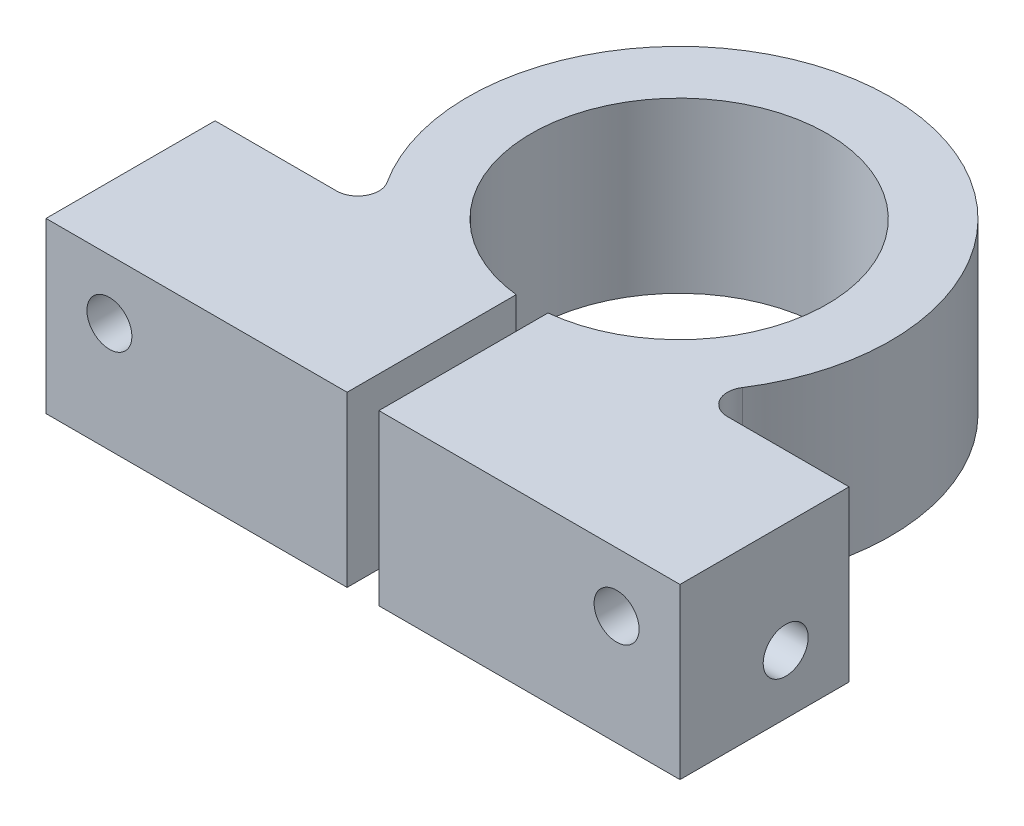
ISO-10303-21;
HEADER;
FILE_DESCRIPTION(('STEP AP214'),'2;1');
FILE_NAME('part.step','',(''),(''),'','','');
FILE_SCHEMA(('AUTOMOTIVE_DESIGN { 1 0 10303 214 1 1 1 1 }'));
ENDSEC;
DATA;
#1=APPLICATION_CONTEXT('core data for automotive mechanical design processes');
#2=APPLICATION_PROTOCOL_DEFINITION('international standard','automotive_design',2000,#1);
#3=PRODUCT_CONTEXT('',#1,'mechanical');
#4=PRODUCT('Part','Part','',(#3));
#5=PRODUCT_RELATED_PRODUCT_CATEGORY('part','',(#4));
#6=PRODUCT_DEFINITION_FORMATION('','',#4);
#7=PRODUCT_DEFINITION_CONTEXT('part definition',#1,'design');
#8=PRODUCT_DEFINITION('design','',#6,#7);
#9=PRODUCT_DEFINITION_SHAPE('','',#8);
#10=(LENGTH_UNIT() NAMED_UNIT(*) SI_UNIT(.MILLI.,.METRE.));
#11=(NAMED_UNIT(*) PLANE_ANGLE_UNIT() SI_UNIT($,.RADIAN.));
#12=(NAMED_UNIT(*) SI_UNIT($,.STERADIAN.) SOLID_ANGLE_UNIT());
#13=UNCERTAINTY_MEASURE_WITH_UNIT(LENGTH_MEASURE(1.E-05),#10,'distance_accuracy_value','');
#14=(GEOMETRIC_REPRESENTATION_CONTEXT(3) GLOBAL_UNCERTAINTY_ASSIGNED_CONTEXT((#13)) GLOBAL_UNIT_ASSIGNED_CONTEXT((#10,
#11,#12)) REPRESENTATION_CONTEXT('',''));
#15=CARTESIAN_POINT('',(0.,0.,0.));
#16=DIRECTION('',(0.,0.,1.));
#17=DIRECTION('',(1.,0.,0.));
#18=AXIS2_PLACEMENT_3D('',#15,#16,#17);
#19=CARTESIAN_POINT('',(-29.355357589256,25.4,18.9213795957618));
#20=DIRECTION('',(0.,-1.,0.));
#21=DIRECTION('',(0.,0.,-1.));
#22=AXIS2_PLACEMENT_3D('',#19,#20,#21);
#23=CYLINDRICAL_SURFACE('',#22,3.175);
#24=CARTESIAN_POINT('',(-29.355357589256,0.,18.9213795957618));
#25=DIRECTION('',(0.,-1.,0.));
#26=DIRECTION('',(0.,0.,1.));
#27=AXIS2_PLACEMENT_3D('',#24,#25,#26);
#28=CIRCLE('',#27,3.175);
#29=CARTESIAN_POINT('',(-26.6866887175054,0.,17.2012541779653));
#30=VERTEX_POINT('',#29);
#31=CARTESIAN_POINT('',(-29.355357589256,0.,22.0963795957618));
#32=VERTEX_POINT('',#31);
#33=EDGE_CURVE('E124',#30,#32,#28,.T.);
#34=ORIENTED_EDGE('',*,*,#33,.T.);
#35=DIRECTION('',(0.,-1.,0.));
#36=VECTOR('',#35,1.);
#37=CARTESIAN_POINT('',(-29.355357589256,25.4,22.0963795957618));
#38=LINE('',#37,#36);
#39=CARTESIAN_POINT('',(-29.355357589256,25.4,22.0963795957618));
#40=VERTEX_POINT('',#39);
#41=EDGE_CURVE('E11',#40,#32,#38,.T.);
#42=ORIENTED_EDGE('',*,*,#41,.F.);
#43=CARTESIAN_POINT('',(-29.355357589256,25.4,18.9213795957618));
#44=DIRECTION('',(0.,-1.,0.));
#45=DIRECTION('',(0.,0.,1.));
#46=AXIS2_PLACEMENT_3D('',#43,#44,#45);
#47=CIRCLE('',#46,3.175);
#48=CARTESIAN_POINT('',(-26.6866887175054,25.4,17.2012541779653));
#49=VERTEX_POINT('',#48);
#50=EDGE_CURVE('E164',#49,#40,#47,.T.);
#51=ORIENTED_EDGE('',*,*,#50,.F.);
#52=DIRECTION('',(0.,-1.,0.));
#53=VECTOR('',#52,1.);
#54=CARTESIAN_POINT('',(-26.6866887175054,25.4,17.2012541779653));
#55=LINE('',#54,#53);
#56=EDGE_CURVE('E137',#49,#30,#55,.T.);
#57=ORIENTED_EDGE('',*,*,#56,.T.);
#58=EDGE_LOOP('',(#34,#42,#51,#57));
#59=FACE_BOUND('',#58,.T.);
#60=ADVANCED_FACE('F32',(#59),#23,.F.);
#61=CARTESIAN_POINT('',(-47.625,25.4,22.0963795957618));
#62=DIRECTION('',(0.,0.,1.));
#63=DIRECTION('',(1.,0.,0.));
#64=AXIS2_PLACEMENT_3D('',#61,#62,#63);
#65=PLANE('',#64);
#66=CARTESIAN_POINT('',(-38.1,16.51,22.0963795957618));
#67=DIRECTION('',(0.,0.,-1.));
#68=DIRECTION('',(-1.,0.,0.));
#69=AXIS2_PLACEMENT_3D('',#66,#67,#68);
#70=CIRCLE('',#69,3.37819999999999);
#71=CARTESIAN_POINT('',(-41.4782,16.51,22.0963795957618));
#72=VERTEX_POINT('',#71);
#73=EDGE_CURVE('E305',#72,#72,#70,.T.);
#74=ORIENTED_EDGE('',*,*,#73,.F.);
#75=EDGE_LOOP('',(#74));
#76=FACE_BOUND('',#75,.T.);
#77=DIRECTION('',(-1.,0.,0.));
#78=VECTOR('',#77,1.);
#79=CARTESIAN_POINT('',(-47.625,0.,22.0963795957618));
#80=LINE('',#79,#78);
#81=CARTESIAN_POINT('',(-47.625,0.,22.0963795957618));
#82=VERTEX_POINT('',#81);
#83=EDGE_CURVE('E120',#32,#82,#80,.T.);
#84=ORIENTED_EDGE('',*,*,#83,.T.);
#85=DIRECTION('',(0.,-1.,0.));
#86=VECTOR('',#85,1.);
#87=CARTESIAN_POINT('',(-47.625,25.4,22.0963795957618));
#88=LINE('',#87,#86);
#89=CARTESIAN_POINT('',(-47.625,25.4,22.0963795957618));
#90=VERTEX_POINT('',#89);
#91=EDGE_CURVE('E39',#90,#82,#88,.T.);
#92=ORIENTED_EDGE('',*,*,#91,.F.);
#93=DIRECTION('',(-1.,0.,0.));
#94=VECTOR('',#93,1.);
#95=CARTESIAN_POINT('',(-47.625,25.4,22.0963795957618));
#96=LINE('',#95,#94);
#97=EDGE_CURVE('E133',#40,#90,#96,.T.);
#98=ORIENTED_EDGE('',*,*,#97,.F.);
#99=ORIENTED_EDGE('',*,*,#41,.T.);
#100=EDGE_LOOP('',(#84,#92,#98,#99));
#101=FACE_BOUND('',#100,.T.);
#102=ADVANCED_FACE('F132',(#76,#101),#65,.F.);
#103=CARTESIAN_POINT('',(-47.625,25.4,22.0963795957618));
#104=DIRECTION('',(1.,0.,0.));
#105=DIRECTION('',(0.,0.,-1.));
#106=AXIS2_PLACEMENT_3D('',#103,#104,#105);
#107=PLANE('',#106);
#108=CARTESIAN_POINT('',(-47.625,8.89,31.6213795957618));
#109=DIRECTION('',(-1.,0.,0.));
#110=DIRECTION('',(0.,0.,1.));
#111=AXIS2_PLACEMENT_3D('',#108,#109,#110);
#112=CIRCLE('',#111,3.37819999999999);
#113=CARTESIAN_POINT('',(-47.625,8.89,34.9995795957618));
#114=VERTEX_POINT('',#113);
#115=EDGE_CURVE('E315',#114,#114,#112,.T.);
#116=ORIENTED_EDGE('',*,*,#115,.F.);
#117=EDGE_LOOP('',(#116));
#118=FACE_BOUND('',#117,.T.);
#119=DIRECTION('',(0.,0.,1.));
#120=VECTOR('',#119,1.);
#121=CARTESIAN_POINT('',(-47.625,0.,22.0963795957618));
#122=LINE('',#121,#120);
#123=CARTESIAN_POINT('',(-47.625,0.,47.4963795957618));
#124=VERTEX_POINT('',#123);
#125=EDGE_CURVE('E126',#82,#124,#122,.T.);
#126=ORIENTED_EDGE('',*,*,#125,.T.);
#127=DIRECTION('',(0.,-1.,0.));
#128=VECTOR('',#127,1.);
#129=CARTESIAN_POINT('',(-47.625,25.4,47.4963795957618));
#130=LINE('',#129,#128);
#131=CARTESIAN_POINT('',(-47.625,25.4,47.4963795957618));
#132=VERTEX_POINT('',#131);
#133=EDGE_CURVE('E210',#132,#124,#130,.T.);
#134=ORIENTED_EDGE('',*,*,#133,.F.);
#135=DIRECTION('',(0.,0.,1.));
#136=VECTOR('',#135,1.);
#137=CARTESIAN_POINT('',(-47.625,25.4,22.0963795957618));
#138=LINE('',#137,#136);
#139=EDGE_CURVE('E167',#90,#132,#138,.T.);
#140=ORIENTED_EDGE('',*,*,#139,.F.);
#141=ORIENTED_EDGE('',*,*,#91,.T.);
#142=EDGE_LOOP('',(#126,#134,#140,#141));
#143=FACE_BOUND('',#142,.T.);
#144=ADVANCED_FACE('F214',(#118,#143),#107,.F.);
#145=CARTESIAN_POINT('',(-47.625,25.4,47.4963795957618));
#146=DIRECTION('',(0.,0.,-1.));
#147=DIRECTION('',(-1.,0.,0.));
#148=AXIS2_PLACEMENT_3D('',#145,#146,#147);
#149=PLANE('',#148);
#150=CARTESIAN_POINT('',(-38.1,16.51,47.4963795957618));
#151=DIRECTION('',(0.,0.,-1.));
#152=DIRECTION('',(-1.,0.,0.));
#153=AXIS2_PLACEMENT_3D('',#150,#151,#152);
#154=CIRCLE('',#153,3.3782);
#155=CARTESIAN_POINT('',(-41.4782,16.51,47.4963795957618));
#156=VERTEX_POINT('',#155);
#157=EDGE_CURVE('E301',#156,#156,#154,.T.);
#158=ORIENTED_EDGE('',*,*,#157,.T.);
#159=EDGE_LOOP('',(#158));
#160=FACE_BOUND('',#159,.T.);
#161=DIRECTION('',(1.,0.,0.));
#162=VECTOR('',#161,1.);
#163=CARTESIAN_POINT('',(-47.625,0.,47.4963795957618));
#164=LINE('',#163,#162);
#165=CARTESIAN_POINT('',(-2.3876,0.,47.4963795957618));
#166=VERTEX_POINT('',#165);
#167=EDGE_CURVE('E146',#124,#166,#164,.T.);
#168=ORIENTED_EDGE('',*,*,#167,.T.);
#169=DIRECTION('',(0.,-1.,0.));
#170=VECTOR('',#169,1.);
#171=CARTESIAN_POINT('',(-2.3876,25.4,47.4963795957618));
#172=LINE('',#171,#170);
#173=CARTESIAN_POINT('',(-2.3876,25.4,47.4963795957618));
#174=VERTEX_POINT('',#173);
#175=EDGE_CURVE('E207',#174,#166,#172,.T.);
#176=ORIENTED_EDGE('',*,*,#175,.F.);
#177=DIRECTION('',(1.,0.,0.));
#178=VECTOR('',#177,1.);
#179=CARTESIAN_POINT('',(-47.625,25.4,47.4963795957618));
#180=LINE('',#179,#178);
#181=EDGE_CURVE('E169',#132,#174,#180,.T.);
#182=ORIENTED_EDGE('',*,*,#181,.F.);
#183=ORIENTED_EDGE('',*,*,#133,.T.);
#184=EDGE_LOOP('',(#168,#176,#182,#183));
#185=FACE_BOUND('',#184,.T.);
#186=ADVANCED_FACE('F222',(#160,#185),#149,.F.);
#187=CARTESIAN_POINT('',(-2.3876,25.4,47.4963795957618));
#188=DIRECTION('',(-1.,0.,0.));
#189=DIRECTION('',(0.,0.,1.));
#190=AXIS2_PLACEMENT_3D('',#187,#188,#189);
#191=PLANE('',#190);
#192=CARTESIAN_POINT('',(-2.3876,8.89,31.6213795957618));
#193=DIRECTION('',(-1.,0.,0.));
#194=DIRECTION('',(0.,0.,1.));
#195=AXIS2_PLACEMENT_3D('',#192,#193,#194);
#196=CIRCLE('',#195,3.37819999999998);
#197=CARTESIAN_POINT('',(-2.3876,8.89,34.9995795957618));
#198=VERTEX_POINT('',#197);
#199=EDGE_CURVE('E138',#198,#198,#196,.T.);
#200=ORIENTED_EDGE('',*,*,#199,.T.);
#201=EDGE_LOOP('',(#200));
#202=FACE_BOUND('',#201,.T.);
#203=DIRECTION('',(0.,0.,-1.));
#204=VECTOR('',#203,1.);
#205=CARTESIAN_POINT('',(-2.3876,0.,47.4963795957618));
#206=LINE('',#205,#204);
#207=CARTESIAN_POINT('',(-2.3876,0.,22.0963795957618));
#208=VERTEX_POINT('',#207);
#209=EDGE_CURVE('E148',#166,#208,#206,.T.);
#210=ORIENTED_EDGE('',*,*,#209,.T.);
#211=DIRECTION('',(0.,-1.,0.));
#212=VECTOR('',#211,1.);
#213=CARTESIAN_POINT('',(-2.3876,25.4,22.0963795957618));
#214=LINE('',#213,#212);
#215=CARTESIAN_POINT('',(-2.3876,25.4,22.0963795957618));
#216=VERTEX_POINT('',#215);
#217=EDGE_CURVE('E204',#216,#208,#214,.T.);
#218=ORIENTED_EDGE('',*,*,#217,.F.);
#219=DIRECTION('',(0.,0.,-1.));
#220=VECTOR('',#219,1.);
#221=CARTESIAN_POINT('',(-2.3876,25.4,47.4963795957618));
#222=LINE('',#221,#220);
#223=EDGE_CURVE('E171',#174,#216,#222,.T.);
#224=ORIENTED_EDGE('',*,*,#223,.F.);
#225=ORIENTED_EDGE('',*,*,#175,.T.);
#226=EDGE_LOOP('',(#210,#218,#224,#225));
#227=FACE_BOUND('',#226,.T.);
#228=ADVANCED_FACE('F225',(#202,#227),#191,.F.);
#229=CARTESIAN_POINT('',(0.,25.4,0.));
#230=DIRECTION('',(0.,-1.,0.));
#231=DIRECTION('',(0.,0.,-1.));
#232=AXIS2_PLACEMENT_3D('',#229,#230,#231);
#233=CYLINDRICAL_SURFACE('',#232,22.225);
#234=CARTESIAN_POINT('',(0.,0.,0.));
#235=DIRECTION('',(0.,-1.,0.));
#236=DIRECTION('',(0.,0.,1.));
#237=AXIS2_PLACEMENT_3D('',#234,#235,#236);
#238=CIRCLE('',#237,22.225);
#239=CARTESIAN_POINT('',(2.3876,0.,22.0963795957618));
#240=VERTEX_POINT('',#239);
#241=EDGE_CURVE('E150',#208,#240,#238,.T.);
#242=ORIENTED_EDGE('',*,*,#241,.T.);
#243=DIRECTION('',(0.,-1.,0.));
#244=VECTOR('',#243,1.);
#245=CARTESIAN_POINT('',(2.3876,25.4,22.0963795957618));
#246=LINE('',#245,#244);
#247=CARTESIAN_POINT('',(2.3876,25.4,22.0963795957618));
#248=VERTEX_POINT('',#247);
#249=EDGE_CURVE('E201',#248,#240,#246,.T.);
#250=ORIENTED_EDGE('',*,*,#249,.F.);
#251=CARTESIAN_POINT('',(0.,25.4,0.));
#252=DIRECTION('',(0.,-1.,0.));
#253=DIRECTION('',(0.,0.,1.));
#254=AXIS2_PLACEMENT_3D('',#251,#252,#253);
#255=CIRCLE('',#254,22.225);
#256=EDGE_CURVE('E173',#216,#248,#255,.T.);
#257=ORIENTED_EDGE('',*,*,#256,.F.);
#258=ORIENTED_EDGE('',*,*,#217,.T.);
#259=EDGE_LOOP('',(#242,#250,#257,#258));
#260=FACE_BOUND('',#259,.T.);
#261=ADVANCED_FACE('F230',(#260),#233,.F.);
#262=CARTESIAN_POINT('',(2.3876,25.4,47.4963795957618));
#263=DIRECTION('',(1.,0.,0.));
#264=DIRECTION('',(0.,0.,-1.));
#265=AXIS2_PLACEMENT_3D('',#262,#263,#264);
#266=PLANE('',#265);
#267=CARTESIAN_POINT('',(2.3876,8.89,31.6213795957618));
#268=DIRECTION('',(1.,0.,0.));
#269=DIRECTION('',(0.,0.,-1.));
#270=AXIS2_PLACEMENT_3D('',#267,#268,#269);
#271=CIRCLE('',#270,3.37819999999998);
#272=CARTESIAN_POINT('',(2.3876,8.89,28.2431795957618));
#273=VERTEX_POINT('',#272);
#274=EDGE_CURVE('E141',#273,#273,#271,.T.);
#275=ORIENTED_EDGE('',*,*,#274,.T.);
#276=EDGE_LOOP('',(#275));
#277=FACE_BOUND('',#276,.T.);
#278=DIRECTION('',(0.,0.,1.));
#279=VECTOR('',#278,1.);
#280=CARTESIAN_POINT('',(2.3876,0.,47.4963795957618));
#281=LINE('',#280,#279);
#282=CARTESIAN_POINT('',(2.3876,0.,47.4963795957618));
#283=VERTEX_POINT('',#282);
#284=EDGE_CURVE('E152',#240,#283,#281,.T.);
#285=ORIENTED_EDGE('',*,*,#284,.T.);
#286=DIRECTION('',(0.,-1.,0.));
#287=VECTOR('',#286,1.);
#288=CARTESIAN_POINT('',(2.3876,25.4,47.4963795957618));
#289=LINE('',#288,#287);
#290=CARTESIAN_POINT('',(2.3876,25.4,47.4963795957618));
#291=VERTEX_POINT('',#290);
#292=EDGE_CURVE('E198',#291,#283,#289,.T.);
#293=ORIENTED_EDGE('',*,*,#292,.F.);
#294=DIRECTION('',(0.,0.,1.));
#295=VECTOR('',#294,1.);
#296=CARTESIAN_POINT('',(2.3876,25.4,47.4963795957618));
#297=LINE('',#296,#295);
#298=EDGE_CURVE('E175',#248,#291,#297,.T.);
#299=ORIENTED_EDGE('',*,*,#298,.F.);
#300=ORIENTED_EDGE('',*,*,#249,.T.);
#301=EDGE_LOOP('',(#285,#293,#299,#300));
#302=FACE_BOUND('',#301,.T.);
#303=ADVANCED_FACE('F236',(#277,#302),#266,.F.);
#304=CARTESIAN_POINT('',(2.3876,25.4,47.4963795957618));
#305=DIRECTION('',(0.,0.,-1.));
#306=DIRECTION('',(-1.,0.,0.));
#307=AXIS2_PLACEMENT_3D('',#304,#305,#306);
#308=PLANE('',#307);
#309=CARTESIAN_POINT('',(38.1,16.51,47.4963795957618));
#310=DIRECTION('',(0.,0.,-1.));
#311=DIRECTION('',(-1.,0.,0.));
#312=AXIS2_PLACEMENT_3D('',#309,#310,#311);
#313=CIRCLE('',#312,3.3782);
#314=CARTESIAN_POINT('',(34.7218,16.51,47.4963795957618));
#315=VERTEX_POINT('',#314);
#316=EDGE_CURVE('E302',#315,#315,#313,.T.);
#317=ORIENTED_EDGE('',*,*,#316,.T.);
#318=EDGE_LOOP('',(#317));
#319=FACE_BOUND('',#318,.T.);
#320=DIRECTION('',(1.,0.,0.));
#321=VECTOR('',#320,1.);
#322=CARTESIAN_POINT('',(2.3876,0.,47.4963795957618));
#323=LINE('',#322,#321);
#324=CARTESIAN_POINT('',(47.625,0.,47.4963795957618));
#325=VERTEX_POINT('',#324);
#326=EDGE_CURVE('E154',#283,#325,#323,.T.);
#327=ORIENTED_EDGE('',*,*,#326,.T.);
#328=DIRECTION('',(0.,-1.,0.));
#329=VECTOR('',#328,1.);
#330=CARTESIAN_POINT('',(47.625,25.4,47.4963795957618));
#331=LINE('',#330,#329);
#332=CARTESIAN_POINT('',(47.625,25.4,47.4963795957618));
#333=VERTEX_POINT('',#332);
#334=EDGE_CURVE('E195',#333,#325,#331,.T.);
#335=ORIENTED_EDGE('',*,*,#334,.F.);
#336=DIRECTION('',(1.,0.,0.));
#337=VECTOR('',#336,1.);
#338=CARTESIAN_POINT('',(2.3876,25.4,47.4963795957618));
#339=LINE('',#338,#337);
#340=EDGE_CURVE('E177',#291,#333,#339,.T.);
#341=ORIENTED_EDGE('',*,*,#340,.F.);
#342=ORIENTED_EDGE('',*,*,#292,.T.);
#343=EDGE_LOOP('',(#327,#335,#341,#342));
#344=FACE_BOUND('',#343,.T.);
#345=ADVANCED_FACE('F240',(#319,#344),#308,.F.);
#346=CARTESIAN_POINT('',(47.625,25.4,22.0963795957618));
#347=DIRECTION('',(-1.,0.,0.));
#348=DIRECTION('',(0.,0.,1.));
#349=AXIS2_PLACEMENT_3D('',#346,#347,#348);
#350=PLANE('',#349);
#351=CARTESIAN_POINT('',(47.625,8.89,31.6213795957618));
#352=DIRECTION('',(-1.,0.,0.));
#353=DIRECTION('',(0.,0.,1.));
#354=AXIS2_PLACEMENT_3D('',#351,#352,#353);
#355=CIRCLE('',#354,3.37819999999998);
#356=CARTESIAN_POINT('',(47.625,8.89,34.9995795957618));
#357=VERTEX_POINT('',#356);
#358=EDGE_CURVE('E312',#357,#357,#355,.T.);
#359=ORIENTED_EDGE('',*,*,#358,.T.);
#360=EDGE_LOOP('',(#359));
#361=FACE_BOUND('',#360,.T.);
#362=DIRECTION('',(0.,0.,-1.));
#363=VECTOR('',#362,1.);
#364=CARTESIAN_POINT('',(47.625,0.,22.0963795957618));
#365=LINE('',#364,#363);
#366=CARTESIAN_POINT('',(47.625,0.,22.0963795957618));
#367=VERTEX_POINT('',#366);
#368=EDGE_CURVE('E156',#325,#367,#365,.T.);
#369=ORIENTED_EDGE('',*,*,#368,.T.);
#370=DIRECTION('',(0.,-1.,0.));
#371=VECTOR('',#370,1.);
#372=CARTESIAN_POINT('',(47.625,25.4,22.0963795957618));
#373=LINE('',#372,#371);
#374=CARTESIAN_POINT('',(47.625,25.4,22.0963795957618));
#375=VERTEX_POINT('',#374);
#376=EDGE_CURVE('E192',#375,#367,#373,.T.);
#377=ORIENTED_EDGE('',*,*,#376,.F.);
#378=DIRECTION('',(0.,0.,-1.));
#379=VECTOR('',#378,1.);
#380=CARTESIAN_POINT('',(47.625,25.4,22.0963795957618));
#381=LINE('',#380,#379);
#382=EDGE_CURVE('E179',#333,#375,#381,.T.);
#383=ORIENTED_EDGE('',*,*,#382,.F.);
#384=ORIENTED_EDGE('',*,*,#334,.T.);
#385=EDGE_LOOP('',(#369,#377,#383,#384));
#386=FACE_BOUND('',#385,.T.);
#387=ADVANCED_FACE('F245',(#361,#386),#350,.F.);
#388=CARTESIAN_POINT('',(29.355357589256,25.4,22.0963795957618));
#389=DIRECTION('',(0.,0.,1.));
#390=DIRECTION('',(1.,0.,0.));
#391=AXIS2_PLACEMENT_3D('',#388,#389,#390);
#392=PLANE('',#391);
#393=CARTESIAN_POINT('',(38.1,16.51,22.0963795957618));
#394=DIRECTION('',(0.,0.,-1.));
#395=DIRECTION('',(-1.,0.,0.));
#396=AXIS2_PLACEMENT_3D('',#393,#394,#395);
#397=CIRCLE('',#396,3.37819999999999);
#398=CARTESIAN_POINT('',(34.7218,16.51,22.0963795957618));
#399=VERTEX_POINT('',#398);
#400=EDGE_CURVE('E299',#399,#399,#397,.T.);
#401=ORIENTED_EDGE('',*,*,#400,.F.);
#402=EDGE_LOOP('',(#401));
#403=FACE_BOUND('',#402,.T.);
#404=DIRECTION('',(-1.,0.,0.));
#405=VECTOR('',#404,1.);
#406=CARTESIAN_POINT('',(29.355357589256,0.,22.0963795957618));
#407=LINE('',#406,#405);
#408=CARTESIAN_POINT('',(29.355357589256,0.,22.0963795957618));
#409=VERTEX_POINT('',#408);
#410=EDGE_CURVE('E158',#367,#409,#407,.T.);
#411=ORIENTED_EDGE('',*,*,#410,.T.);
#412=DIRECTION('',(0.,-1.,0.));
#413=VECTOR('',#412,1.);
#414=CARTESIAN_POINT('',(29.355357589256,25.4,22.0963795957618));
#415=LINE('',#414,#413);
#416=CARTESIAN_POINT('',(29.355357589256,25.4,22.0963795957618));
#417=VERTEX_POINT('',#416);
#418=EDGE_CURVE('E189',#417,#409,#415,.T.);
#419=ORIENTED_EDGE('',*,*,#418,.F.);
#420=DIRECTION('',(-1.,0.,0.));
#421=VECTOR('',#420,1.);
#422=CARTESIAN_POINT('',(29.355357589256,25.4,22.0963795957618));
#423=LINE('',#422,#421);
#424=EDGE_CURVE('E181',#375,#417,#423,.T.);
#425=ORIENTED_EDGE('',*,*,#424,.F.);
#426=ORIENTED_EDGE('',*,*,#376,.T.);
#427=EDGE_LOOP('',(#411,#419,#425,#426));
#428=FACE_BOUND('',#427,.T.);
#429=ADVANCED_FACE('F249',(#403,#428),#392,.F.);
#430=CARTESIAN_POINT('',(29.355357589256,25.4,18.9213795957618));
#431=DIRECTION('',(0.,-1.,0.));
#432=DIRECTION('',(0.,0.,-1.));
#433=AXIS2_PLACEMENT_3D('',#430,#431,#432);
#434=CYLINDRICAL_SURFACE('',#433,3.175);
#435=CARTESIAN_POINT('',(29.355357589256,0.,18.9213795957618));
#436=DIRECTION('',(0.,-1.,0.));
#437=DIRECTION('',(0.,0.,1.));
#438=AXIS2_PLACEMENT_3D('',#435,#436,#437);
#439=CIRCLE('',#438,3.175);
#440=CARTESIAN_POINT('',(26.6866887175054,0.,17.2012541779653));
#441=VERTEX_POINT('',#440);
#442=EDGE_CURVE('E160',#409,#441,#439,.T.);
#443=ORIENTED_EDGE('',*,*,#442,.T.);
#444=DIRECTION('',(0.,-1.,0.));
#445=VECTOR('',#444,1.);
#446=CARTESIAN_POINT('',(26.6866887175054,25.4,17.2012541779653));
#447=LINE('',#446,#445);
#448=CARTESIAN_POINT('',(26.6866887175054,25.4,17.2012541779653));
#449=VERTEX_POINT('',#448);
#450=EDGE_CURVE('E186',#449,#441,#447,.T.);
#451=ORIENTED_EDGE('',*,*,#450,.F.);
#452=CARTESIAN_POINT('',(29.355357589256,25.4,18.9213795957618));
#453=DIRECTION('',(0.,-1.,0.));
#454=DIRECTION('',(0.,0.,1.));
#455=AXIS2_PLACEMENT_3D('',#452,#453,#454);
#456=CIRCLE('',#455,3.175);
#457=EDGE_CURVE('E51',#417,#449,#456,.T.);
#458=ORIENTED_EDGE('',*,*,#457,.F.);
#459=ORIENTED_EDGE('',*,*,#418,.T.);
#460=EDGE_LOOP('',(#443,#451,#458,#459));
#461=FACE_BOUND('',#460,.T.);
#462=ADVANCED_FACE('F253',(#461),#434,.F.);
#463=CARTESIAN_POINT('',(0.,25.4,0.));
#464=DIRECTION('',(0.,-1.,0.));
#465=DIRECTION('',(0.,0.,-1.));
#466=AXIS2_PLACEMENT_3D('',#463,#464,#465);
#467=CYLINDRICAL_SURFACE('',#466,31.75);
#468=CARTESIAN_POINT('',(0.,0.,0.));
#469=DIRECTION('',(0.,1.,0.));
#470=DIRECTION('',(0.,0.,1.));
#471=AXIS2_PLACEMENT_3D('',#468,#469,#470);
#472=CIRCLE('',#471,31.75);
#473=EDGE_CURVE('E162',#441,#30,#472,.T.);
#474=ORIENTED_EDGE('',*,*,#473,.T.);
#475=ORIENTED_EDGE('',*,*,#56,.F.);
#476=CARTESIAN_POINT('',(0.,25.4,0.));
#477=DIRECTION('',(0.,1.,0.));
#478=DIRECTION('',(0.,0.,1.));
#479=AXIS2_PLACEMENT_3D('',#476,#477,#478);
#480=CIRCLE('',#479,31.75);
#481=EDGE_CURVE('E46',#449,#49,#480,.T.);
#482=ORIENTED_EDGE('',*,*,#481,.F.);
#483=ORIENTED_EDGE('',*,*,#450,.T.);
#484=EDGE_LOOP('',(#474,#475,#482,#483));
#485=FACE_BOUND('',#484,.T.);
#486=ADVANCED_FACE('F255',(#485),#467,.T.);
#487=CARTESIAN_POINT('',(-29.355357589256,25.4,18.9213795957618));
#488=DIRECTION('',(0.,1.,0.));
#489=DIRECTION('',(0.,0.,1.));
#490=AXIS2_PLACEMENT_3D('',#487,#488,#489);
#491=PLANE('',#490);
#492=ORIENTED_EDGE('',*,*,#50,.T.);
#493=ORIENTED_EDGE('',*,*,#97,.T.);
#494=ORIENTED_EDGE('',*,*,#139,.T.);
#495=ORIENTED_EDGE('',*,*,#181,.T.);
#496=ORIENTED_EDGE('',*,*,#223,.T.);
#497=ORIENTED_EDGE('',*,*,#256,.T.);
#498=ORIENTED_EDGE('',*,*,#298,.T.);
#499=ORIENTED_EDGE('',*,*,#340,.T.);
#500=ORIENTED_EDGE('',*,*,#382,.T.);
#501=ORIENTED_EDGE('',*,*,#424,.T.);
#502=ORIENTED_EDGE('',*,*,#457,.T.);
#503=ORIENTED_EDGE('',*,*,#481,.T.);
#504=EDGE_LOOP('',(#492,#493,#494,#495,#496,#497,#498,#499,#500,#501,#502,#503));
#505=FACE_BOUND('',#504,.T.);
#506=ADVANCED_FACE('F217',(#505),#491,.T.);
#507=CARTESIAN_POINT('',(-29.355357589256,0.,18.9213795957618));
#508=DIRECTION('',(0.,1.,0.));
#509=DIRECTION('',(0.,0.,1.));
#510=AXIS2_PLACEMENT_3D('',#507,#508,#509);
#511=PLANE('',#510);
#512=ORIENTED_EDGE('',*,*,#33,.F.);
#513=ORIENTED_EDGE('',*,*,#473,.F.);
#514=ORIENTED_EDGE('',*,*,#442,.F.);
#515=ORIENTED_EDGE('',*,*,#410,.F.);
#516=ORIENTED_EDGE('',*,*,#368,.F.);
#517=ORIENTED_EDGE('',*,*,#326,.F.);
#518=ORIENTED_EDGE('',*,*,#284,.F.);
#519=ORIENTED_EDGE('',*,*,#241,.F.);
#520=ORIENTED_EDGE('',*,*,#209,.F.);
#521=ORIENTED_EDGE('',*,*,#167,.F.);
#522=ORIENTED_EDGE('',*,*,#125,.F.);
#523=ORIENTED_EDGE('',*,*,#83,.F.);
#524=EDGE_LOOP('',(#512,#513,#514,#515,#516,#517,#518,#519,#520,#521,#522,#523));
#525=FACE_BOUND('',#524,.T.);
#526=ADVANCED_FACE('F121',(#525),#511,.F.);
#527=CARTESIAN_POINT('',(-47.625,8.89,31.6213795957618));
#528=DIRECTION('',(-1.,0.,0.));
#529=DIRECTION('',(0.,0.,1.));
#530=AXIS2_PLACEMENT_3D('',#527,#528,#529);
#531=CYLINDRICAL_SURFACE('',#530,3.37819999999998);
#532=ORIENTED_EDGE('',*,*,#358,.F.);
#533=EDGE_LOOP('',(#532));
#534=FACE_BOUND('',#533,.T.);
#535=ORIENTED_EDGE('',*,*,#274,.F.);
#536=EDGE_LOOP('',(#535));
#537=FACE_BOUND('',#536,.T.);
#538=ADVANCED_FACE('F320',(#534,#537),#531,.F.);
#539=ORIENTED_EDGE('',*,*,#115,.T.);
#540=EDGE_LOOP('',(#539));
#541=FACE_BOUND('',#540,.T.);
#542=ORIENTED_EDGE('',*,*,#199,.F.);
#543=EDGE_LOOP('',(#542));
#544=FACE_BOUND('',#543,.T.);
#545=ADVANCED_FACE('F322',(#541,#544),#531,.F.);
#546=CARTESIAN_POINT('',(-38.1,16.51,22.0963795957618));
#547=DIRECTION('',(0.,0.,-1.));
#548=DIRECTION('',(-1.,0.,0.));
#549=AXIS2_PLACEMENT_3D('',#546,#547,#548);
#550=CYLINDRICAL_SURFACE('',#549,3.37819999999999);
#551=ORIENTED_EDGE('',*,*,#157,.F.);
#552=EDGE_LOOP('',(#551));
#553=FACE_BOUND('',#552,.T.);
#554=ORIENTED_EDGE('',*,*,#73,.T.);
#555=EDGE_LOOP('',(#554));
#556=FACE_BOUND('',#555,.T.);
#557=ADVANCED_FACE('F329',(#553,#556),#550,.F.);
#558=CARTESIAN_POINT('',(38.1,16.51,22.0963795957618));
#559=DIRECTION('',(0.,0.,-1.));
#560=DIRECTION('',(-1.,0.,0.));
#561=AXIS2_PLACEMENT_3D('',#558,#559,#560);
#562=CYLINDRICAL_SURFACE('',#561,3.37819999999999);
#563=ORIENTED_EDGE('',*,*,#316,.F.);
#564=EDGE_LOOP('',(#563));
#565=FACE_BOUND('',#564,.T.);
#566=ORIENTED_EDGE('',*,*,#400,.T.);
#567=EDGE_LOOP('',(#566));
#568=FACE_BOUND('',#567,.T.);
#569=ADVANCED_FACE('F336',(#565,#568),#562,.F.);
#570=CLOSED_SHELL('',(#60,#102,#144,#186,#228,#261,#303,#345,#387,#429,#462,#486,#506,#526,#538,
#545,#557,#569));
#571=MANIFOLD_SOLID_BREP('B2',#570);
#572=ADVANCED_BREP_SHAPE_REPRESENTATION('',(#18,#571),#14);
#573=SHAPE_DEFINITION_REPRESENTATION(#9,#572);
ENDSEC;
END-ISO-10303-21;
